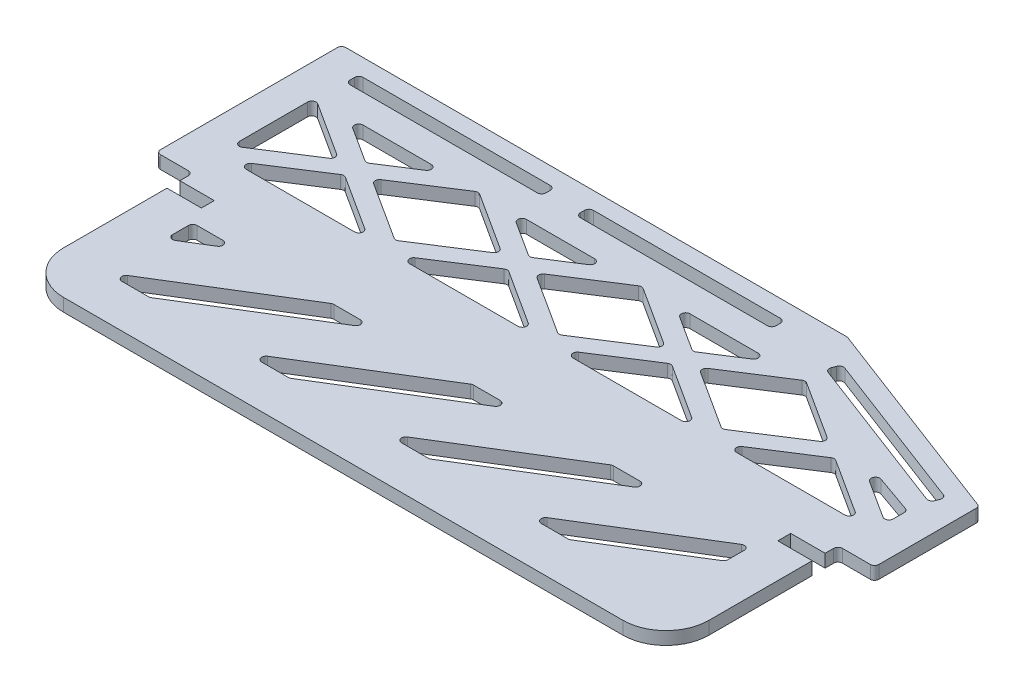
from build123d import *

# Parameters (mm, degrees)
BOSS_EXTRUDE1_DEPTH = 3
SKETCH2_W           = 33.488316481
SKETCH2_H           = 3
BOSS_EXTRUDE2_DEPTH = 3.1
FILLET1_R           = 10
FILLET2_R           = 1
CUT_EXTRUDE1_DEPTH  = 10
SKETCH5_W           = 11
SKETCH5_H           = 4.1
BOSS_EXTRUDE3_DEPTH = 3
SKETCH6_W           = 45.5
SKETCH6_H           = 3
CUT_EXTRUDE2_DEPTH  = 10
FILLET5_R           = 1
FILLET6_R           = 1
FILLET7_R           = 1
SKETCH7_W           = 8
SKETCH7_H           = 3
CUT_EXTRUDE3_DEPTH  = 99.482790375


with BuildPart() as part:
    # Sketch1 → Boss-Extrude1 (new body)
    with BuildSketch(Plane(origin=(0, 0, 0), x_dir=(1, 0, 0), z_dir=(0, 1, 0))):
        Polygon((70, -40), (-80, -40), (-80, 0), (-88.5, 0), (-88.5, 40), (-78.5, 40), (-78.5, 43.1), (18.5, 43.1), (18.5, 40), (28.5, 40), (78.5, 21), (78.5, 0), (70, 0), align=None)
    extrude(amount=BOSS_EXTRUDE1_DEPTH)

    # Sketch2 → Boss-Extrude2 (add)
    with BuildSketch(Plane(origin=(16.878189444, 0, -44.416288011), x_dir=(-0.9347835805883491, 0, -0.35521776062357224), z_dir=(0.35521776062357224, 0, -0.9347835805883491))):
        with Locations((-39.176779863, 1.5)):
            Rectangle(SKETCH2_W, SKETCH2_H)
    extrude(amount=BOSS_EXTRUDE2_DEPTH)

    # Fillet1
    fillet1_edges = [part.edges().sort_by_distance(p)[0] for p in [
        (70, 1.5, 40),
        (-80, 1.5, 40),
    ]]
    fillet(fillet1_edges, radius=FILLET1_R)

    # Fillet2
    fillet2_edges = [part.edges().sort_by_distance(p)[0] for p in [
        (-78.5, 1.5, -43.1),
        (18.5, 1.5, -43.1),
        (18.5, 1.5, -40),
        (28.5, 1.5, -40),
        (78.5, 1.5, -21),
        (78.5, 1.5, 0),
        (70, 1.5, 0),
        (-80, 1.5, 0),
        (-88.5, 1.5, 0),
        (-88.5, 1.5, -40),
        (-78.5, 1.5, -40),
        (69.152164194, 1.5, -24.552177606),
        (37.847835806, 1.5, -36.447822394),
        (70.253339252, 1.5, -27.450006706),
        (38.949010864, 1.5, -39.345651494),
    ]]
    fillet(fillet2_edges, radius=FILLET2_R)

    # Sketch3 → Cut-Extrude1 (cut)
    with BuildSketch(Plane(origin=(0, 3, 0), x_dir=(1, 0, 0), z_dir=(0, 1, 0))):
        Polygon((-37.5, -10), (-27.5, -10), (-60, -30), (-70, -30), align=None)
        Polygon((60, -10), (60, -16.153846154), (37.5, -30), (27.5, -30), align=None)
        Polygon((-59.459302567, -10), (-70, -16.486583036), (-70, -10), align=None)
        Polygon((-37.5, -30), (-27.5, -30), (5, -10), (-5, -10), align=None)
        Polygon((27.5, -10), (37.5, -10), (5, -30), (-5, -30), align=None)
        Polygon((68, 7), (52, 17.285714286), (36, 7), align=None)
        Polygon((71, 10), (71, 15.096394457), (53.507750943, 21.245017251), align=None)
        Polygon((25.333333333, 29.5), (2.666666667, 29.5), (14, 22.214285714), align=None)
        Polygon((-81, 29.5), (-65.833333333, 19.75), (-81, 10), align=None)
        Polygon((-78, 7), (-62, 17.285714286), (-46, 7), align=None)
        Polygon((-73.333333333, 29.5), (-62, 22.214285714), (-50.666666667, 29.5), align=None)
        Polygon((-35.333333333, 29.5), (-24, 22.214285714), (-12.666666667, 29.5), align=None)
        Polygon((-43, 29.5), (-27.833333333, 19.75), (-43, 10), (-58.166666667, 19.75), align=None)
        Polygon((-5, 29.5), (-20.166666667, 19.75), (-5, 10), (10.166666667, 19.75), align=None)
        Polygon((48.166666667, 19.75), (33, 10), (17.833333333, 19.75), (33, 29.5), align=None)
        Polygon((-8, 7), (-40, 7), (-24, 17.285714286), align=None)
        Polygon((-2, 7), (30, 7), (14, 17.285714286), align=None)
    extrude(amount=-CUT_EXTRUDE1_DEPTH, mode=Mode.SUBTRACT)

    # Sketch5 → Boss-Extrude3 (add)
    with BuildSketch(Plane(origin=(0, 3, 0), x_dir=(1, 0, 0), z_dir=(0, 1, 0))):
        with Locations((-83, 41.05)):
            Rectangle(SKETCH5_W, SKETCH5_H)
        Polygon((17.5, 43.1), (29.069146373, 43.1), (39.883794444, 38.990433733), (38.199035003, 34.556856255), (17.5, 38.990433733), align=None)
        Polygon((69.318555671, 27.805224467), (78.5, 24.316275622), (78.5, 20.31023367), (67.604061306, 24.450690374), align=None)
    extrude(amount=-BOSS_EXTRUDE3_DEPTH)

    # Sketch6 → Cut-Extrude2 (cut)
    with BuildSketch(Plane(origin=(0, 0, 0), x_dir=(-1, 0, 0), z_dir=(0, -1, 0))):
        Polygon((-72.862664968, 22.179397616), (-34.069146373, 36.920934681), (-33.003493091, 34.11658394), (-71.797011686, 19.375046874), align=None)
        with Locations((57.75, 37.6)):
            Rectangle(SKETCH6_W, SKETCH6_H)
        with Locations((4.25, 37.6)):
            Rectangle(SKETCH6_W, SKETCH6_H)
    extrude(amount=-CUT_EXTRUDE2_DEPTH, mode=Mode.SUBTRACT)

    # Fillet5
    fillet5_edges = [part.edges().sort_by_distance(p)[0] for p in [
        (-88.5, 1.5, -43.1),
        (29.069146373, 1.5, -43.1),
        (78.5, 1.5, -24.316275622),
    ]]
    fillet(fillet5_edges, radius=FILLET5_R)

    # Fillet6
    fillet6_edges = [part.edges().sort_by_distance(p)[0] for p in [
        (-80.5, 1.5, -39.1),
        (-80.5, 1.5, -36.1),
        (-35, 1.5, -36.1),
        (-35, 1.5, -39.1),
        (18.5, 1.5, -39.1),
        (-27, 1.5, -39.1),
        (-27, 1.5, -36.1),
        (18.5, 1.5, -36.1),
        (71.797011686, 1.5, -19.375046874),
        (72.862664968, 1.5, -22.179397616),
        (34.069146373, 1.5, -36.920934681),
        (33.003493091, 1.5, -34.11658394),
    ]]
    fillet(fillet6_edges, radius=FILLET6_R)

    # Fillet7
    fillet7_edges = [part.edges().sort_by_distance(p)[0] for p in [
        (5, 1.5, 10),
        (-27.5, 1.5, 30),
        (-37.5, 1.5, 30),
        (-5, 1.5, 10),
        (-70, 1.5, 16.486583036),
        (-70, 1.5, 10),
        (-59.459302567, 1.5, 10),
        (68, 1.5, -7),
        (36, 1.5, -7),
        (52, 1.5, -17.285714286),
        (33, 1.5, -29.5),
        (48.166666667, 1.5, -19.75),
        (33, 1.5, -10),
        (17.833333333, 1.5, -19.75),
        (27.5, 1.5, 30),
        (60, 1.5, 10),
        (60, 1.5, 16.153846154),
        (37.5, 1.5, 30),
        (14, 1.5, -22.214285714),
        (2.666666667, 1.5, -29.5),
        (25.333333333, 1.5, -29.5),
        (-5, 1.5, 30),
        (27.5, 1.5, 10),
        (37.5, 1.5, 10),
        (5, 1.5, 30),
        (-70, 1.5, 30),
        (-37.5, 1.5, 10),
        (-27.5, 1.5, 10),
        (-60, 1.5, 30),
        (-81, 1.5, -10),
        (-81, 1.5, -29.5),
        (-65.833333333, 1.5, -19.75),
        (-5, 1.5, -29.5),
        (10.166666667, 1.5, -19.75),
        (-5, 1.5, -10),
        (-20.166666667, 1.5, -19.75),
        (-46, 1.5, -7),
        (-78, 1.5, -7),
        (-62, 1.5, -17.285714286),
        (-40, 1.5, -7),
        (-24, 1.5, -17.285714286),
        (-8, 1.5, -7),
        (-58.166666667, 1.5, -19.75),
        (-43, 1.5, -29.5),
        (-27.833333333, 1.5, -19.75),
        (-43, 1.5, -10),
        (-50.666666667, 1.5, -29.5),
        (-62, 1.5, -22.214285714),
        (-73.333333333, 1.5, -29.5),
        (-2, 1.5, -7),
        (14, 1.5, -17.285714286),
        (30, 1.5, -7),
        (-12.666666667, 1.5, -29.5),
        (-24, 1.5, -22.214285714),
        (-35.333333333, 1.5, -29.5),
        (53.507750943, 1.5, -21.245017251),
        (71, 1.5, -15.096394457),
        (71, 1.5, -10),
    ]]
    fillet(fillet7_edges, radius=FILLET7_R)

    # Sketch7 → Cut-Extrude3 (cut, through all)
    with BuildSketch(Plane.XZ):
        with Locations((66, 4.5)):
            Rectangle(SKETCH7_W, SKETCH7_H)
        with Locations((-76, 4.5)):
            Rectangle(SKETCH7_W, SKETCH7_H)
    extrude(amount=-CUT_EXTRUDE3_DEPTH, mode=Mode.SUBTRACT)


solid = part.part
